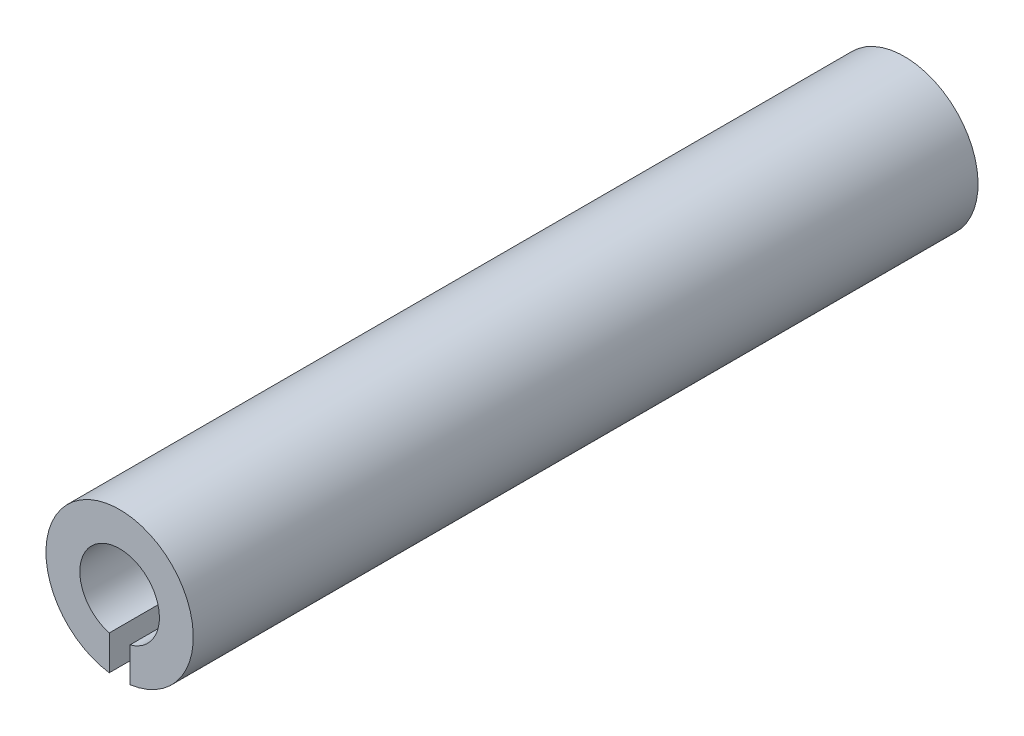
ISO-10303-21;
HEADER;
FILE_DESCRIPTION(('STEP AP214'),'2;1');
FILE_NAME('part.step','',(''),(''),'','','');
FILE_SCHEMA(('AUTOMOTIVE_DESIGN { 1 0 10303 214 1 1 1 1 }'));
ENDSEC;
DATA;
#1=APPLICATION_CONTEXT('core data for automotive mechanical design processes');
#2=APPLICATION_PROTOCOL_DEFINITION('international standard','automotive_design',2000,#1);
#3=PRODUCT_CONTEXT('',#1,'mechanical');
#4=PRODUCT('Part','Part','',(#3));
#5=PRODUCT_RELATED_PRODUCT_CATEGORY('part','',(#4));
#6=PRODUCT_DEFINITION_FORMATION('','',#4);
#7=PRODUCT_DEFINITION_CONTEXT('part definition',#1,'design');
#8=PRODUCT_DEFINITION('design','',#6,#7);
#9=PRODUCT_DEFINITION_SHAPE('','',#8);
#10=(LENGTH_UNIT() NAMED_UNIT(*) SI_UNIT(.MILLI.,.METRE.));
#11=(NAMED_UNIT(*) PLANE_ANGLE_UNIT() SI_UNIT($,.RADIAN.));
#12=(NAMED_UNIT(*) SI_UNIT($,.STERADIAN.) SOLID_ANGLE_UNIT());
#13=UNCERTAINTY_MEASURE_WITH_UNIT(LENGTH_MEASURE(1.E-05),#10,'distance_accuracy_value','');
#14=(GEOMETRIC_REPRESENTATION_CONTEXT(3) GLOBAL_UNCERTAINTY_ASSIGNED_CONTEXT((#13)) GLOBAL_UNIT_ASSIGNED_CONTEXT((#10,
#11,#12)) REPRESENTATION_CONTEXT('',''));
#15=CARTESIAN_POINT('',(0.,0.,0.));
#16=DIRECTION('',(0.,0.,1.));
#17=DIRECTION('',(1.,0.,0.));
#18=AXIS2_PLACEMENT_3D('',#15,#16,#17);
#19=CARTESIAN_POINT('',(0.,0.,-9.47));
#20=DIRECTION('',(0.,0.,1.));
#21=DIRECTION('',(1.,0.,0.));
#22=AXIS2_PLACEMENT_3D('',#19,#20,#21);
#23=CYLINDRICAL_SURFACE('',#22,0.48);
#24=CARTESIAN_POINT('',(0.,0.,0.));
#25=DIRECTION('',(0.,0.,1.));
#26=DIRECTION('',(1.,0.,0.));
#27=AXIS2_PLACEMENT_3D('',#24,#25,#26);
#28=CIRCLE('',#27,0.48);
#29=CARTESIAN_POINT('',(0.125,-0.4634382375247,0.));
#30=VERTEX_POINT('',#29);
#31=CARTESIAN_POINT('',(-0.125,-0.4634382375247,0.));
#32=VERTEX_POINT('',#31);
#33=EDGE_CURVE('E100',#30,#32,#28,.T.);
#34=ORIENTED_EDGE('',*,*,#33,.T.);
#35=DIRECTION('',(0.,0.,1.));
#36=VECTOR('',#35,1.);
#37=CARTESIAN_POINT('',(-0.125,-0.4634382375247,-9.47));
#38=LINE('',#37,#36);
#39=CARTESIAN_POINT('',(-0.125,-0.4634382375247,-9.47));
#40=VERTEX_POINT('',#39);
#41=EDGE_CURVE('E11',#40,#32,#38,.T.);
#42=ORIENTED_EDGE('',*,*,#41,.F.);
#43=CARTESIAN_POINT('',(0.,0.,-9.47));
#44=DIRECTION('',(0.,0.,1.));
#45=DIRECTION('',(1.,0.,0.));
#46=AXIS2_PLACEMENT_3D('',#43,#44,#45);
#47=CIRCLE('',#46,0.48);
#48=CARTESIAN_POINT('',(0.125,-0.4634382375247,-9.47));
#49=VERTEX_POINT('',#48);
#50=EDGE_CURVE('E95',#49,#40,#47,.T.);
#51=ORIENTED_EDGE('',*,*,#50,.F.);
#52=DIRECTION('',(0.,0.,1.));
#53=VECTOR('',#52,1.);
#54=CARTESIAN_POINT('',(0.125,-0.4634382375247,-9.47));
#55=LINE('',#54,#53);
#56=EDGE_CURVE('E39',#49,#30,#55,.T.);
#57=ORIENTED_EDGE('',*,*,#56,.T.);
#58=EDGE_LOOP('',(#34,#42,#51,#57));
#59=FACE_BOUND('',#58,.T.);
#60=ADVANCED_FACE('F36',(#59),#23,.F.);
#61=CARTESIAN_POINT('',(-0.125,-2.09722135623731,-9.47));
#62=DIRECTION('',(-1.,0.,0.));
#63=DIRECTION('',(0.,-1.,0.));
#64=AXIS2_PLACEMENT_3D('',#61,#62,#63);
#65=PLANE('',#64);
#66=DIRECTION('',(0.,-1.,0.));
#67=VECTOR('',#66,1.);
#68=CARTESIAN_POINT('',(-0.125,-2.09722135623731,0.));
#69=LINE('',#68,#67);
#70=CARTESIAN_POINT('',(-0.125,-0.880168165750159,0.));
#71=VERTEX_POINT('',#70);
#72=EDGE_CURVE('E75',#32,#71,#69,.T.);
#73=ORIENTED_EDGE('',*,*,#72,.T.);
#74=DIRECTION('',(0.,0.,1.));
#75=VECTOR('',#74,1.);
#76=CARTESIAN_POINT('',(-0.125,-0.880168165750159,-9.47));
#77=LINE('',#76,#75);
#78=CARTESIAN_POINT('',(-0.125,-0.880168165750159,-9.47));
#79=VERTEX_POINT('',#78);
#80=EDGE_CURVE('E45',#79,#71,#77,.T.);
#81=ORIENTED_EDGE('',*,*,#80,.F.);
#82=DIRECTION('',(0.,-1.,0.));
#83=VECTOR('',#82,1.);
#84=CARTESIAN_POINT('',(-0.125,-2.09722135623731,-9.47));
#85=LINE('',#84,#83);
#86=EDGE_CURVE('E53',#40,#79,#85,.T.);
#87=ORIENTED_EDGE('',*,*,#86,.F.);
#88=ORIENTED_EDGE('',*,*,#41,.T.);
#89=EDGE_LOOP('',(#73,#81,#87,#88));
#90=FACE_BOUND('',#89,.T.);
#91=ADVANCED_FACE('F107',(#90),#65,.F.);
#92=CARTESIAN_POINT('',(0.,0.,-9.47));
#93=DIRECTION('',(0.,0.,1.));
#94=DIRECTION('',(1.,0.,0.));
#95=AXIS2_PLACEMENT_3D('',#92,#93,#94);
#96=CYLINDRICAL_SURFACE('',#95,0.889);
#97=CARTESIAN_POINT('',(0.,0.,0.));
#98=DIRECTION('',(0.,0.,1.));
#99=DIRECTION('',(1.,0.,0.));
#100=AXIS2_PLACEMENT_3D('',#97,#98,#99);
#101=CIRCLE('',#100,0.889);
#102=CARTESIAN_POINT('',(0.125,-0.880168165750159,0.));
#103=VERTEX_POINT('',#102);
#104=EDGE_CURVE('E87',#103,#71,#101,.T.);
#105=ORIENTED_EDGE('',*,*,#104,.F.);
#106=DIRECTION('',(0.,0.,1.));
#107=VECTOR('',#106,1.);
#108=CARTESIAN_POINT('',(0.125,-0.880168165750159,-9.47));
#109=LINE('',#108,#107);
#110=CARTESIAN_POINT('',(0.125,-0.880168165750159,-9.47));
#111=VERTEX_POINT('',#110);
#112=EDGE_CURVE('E83',#111,#103,#109,.T.);
#113=ORIENTED_EDGE('',*,*,#112,.F.);
#114=CARTESIAN_POINT('',(0.,0.,-9.47));
#115=DIRECTION('',(0.,0.,1.));
#116=DIRECTION('',(1.,0.,0.));
#117=AXIS2_PLACEMENT_3D('',#114,#115,#116);
#118=CIRCLE('',#117,0.889);
#119=EDGE_CURVE('E86',#111,#79,#118,.T.);
#120=ORIENTED_EDGE('',*,*,#119,.T.);
#121=ORIENTED_EDGE('',*,*,#80,.T.);
#122=EDGE_LOOP('',(#105,#113,#120,#121));
#123=FACE_BOUND('',#122,.T.);
#124=ADVANCED_FACE('F85',(#123),#96,.T.);
#125=CARTESIAN_POINT('',(0.125,-2.09722135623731,-9.47));
#126=DIRECTION('',(-1.,0.,0.));
#127=DIRECTION('',(0.,0.,1.));
#128=AXIS2_PLACEMENT_3D('',#125,#126,#127);
#129=PLANE('',#128);
#130=DIRECTION('',(0.,-1.,0.));
#131=VECTOR('',#130,1.);
#132=CARTESIAN_POINT('',(0.125,-2.09722135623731,0.));
#133=LINE('',#132,#131);
#134=EDGE_CURVE('E103',#30,#103,#133,.T.);
#135=ORIENTED_EDGE('',*,*,#134,.F.);
#136=ORIENTED_EDGE('',*,*,#56,.F.);
#137=DIRECTION('',(0.,-1.,0.));
#138=VECTOR('',#137,1.);
#139=CARTESIAN_POINT('',(0.125,-2.09722135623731,-9.47));
#140=LINE('',#139,#138);
#141=EDGE_CURVE('E92',#49,#111,#140,.T.);
#142=ORIENTED_EDGE('',*,*,#141,.T.);
#143=ORIENTED_EDGE('',*,*,#112,.T.);
#144=EDGE_LOOP('',(#135,#136,#142,#143));
#145=FACE_BOUND('',#144,.T.);
#146=ADVANCED_FACE('F94',(#145),#129,.T.);
#147=CARTESIAN_POINT('',(0.,-2.09722135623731,-9.47));
#148=DIRECTION('',(0.,0.,1.));
#149=DIRECTION('',(1.,0.,0.));
#150=AXIS2_PLACEMENT_3D('',#147,#148,#149);
#151=PLANE('',#150);
#152=ORIENTED_EDGE('',*,*,#50,.T.);
#153=ORIENTED_EDGE('',*,*,#86,.T.);
#154=ORIENTED_EDGE('',*,*,#119,.F.);
#155=ORIENTED_EDGE('',*,*,#141,.F.);
#156=EDGE_LOOP('',(#152,#153,#154,#155));
#157=FACE_BOUND('',#156,.T.);
#158=ADVANCED_FACE('F91',(#157),#151,.F.);
#159=CARTESIAN_POINT('',(0.,-2.09722135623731,0.));
#160=DIRECTION('',(0.,0.,1.));
#161=DIRECTION('',(1.,0.,0.));
#162=AXIS2_PLACEMENT_3D('',#159,#160,#161);
#163=PLANE('',#162);
#164=ORIENTED_EDGE('',*,*,#33,.F.);
#165=ORIENTED_EDGE('',*,*,#134,.T.);
#166=ORIENTED_EDGE('',*,*,#104,.T.);
#167=ORIENTED_EDGE('',*,*,#72,.F.);
#168=EDGE_LOOP('',(#164,#165,#166,#167));
#169=FACE_BOUND('',#168,.T.);
#170=ADVANCED_FACE('F109',(#169),#163,.T.);
#171=CLOSED_SHELL('',(#60,#91,#124,#146,#158,#170));
#172=MANIFOLD_SOLID_BREP('B2',#171);
#173=ADVANCED_BREP_SHAPE_REPRESENTATION('',(#18,#172),#14);
#174=SHAPE_DEFINITION_REPRESENTATION(#9,#173);
ENDSEC;
END-ISO-10303-21;
